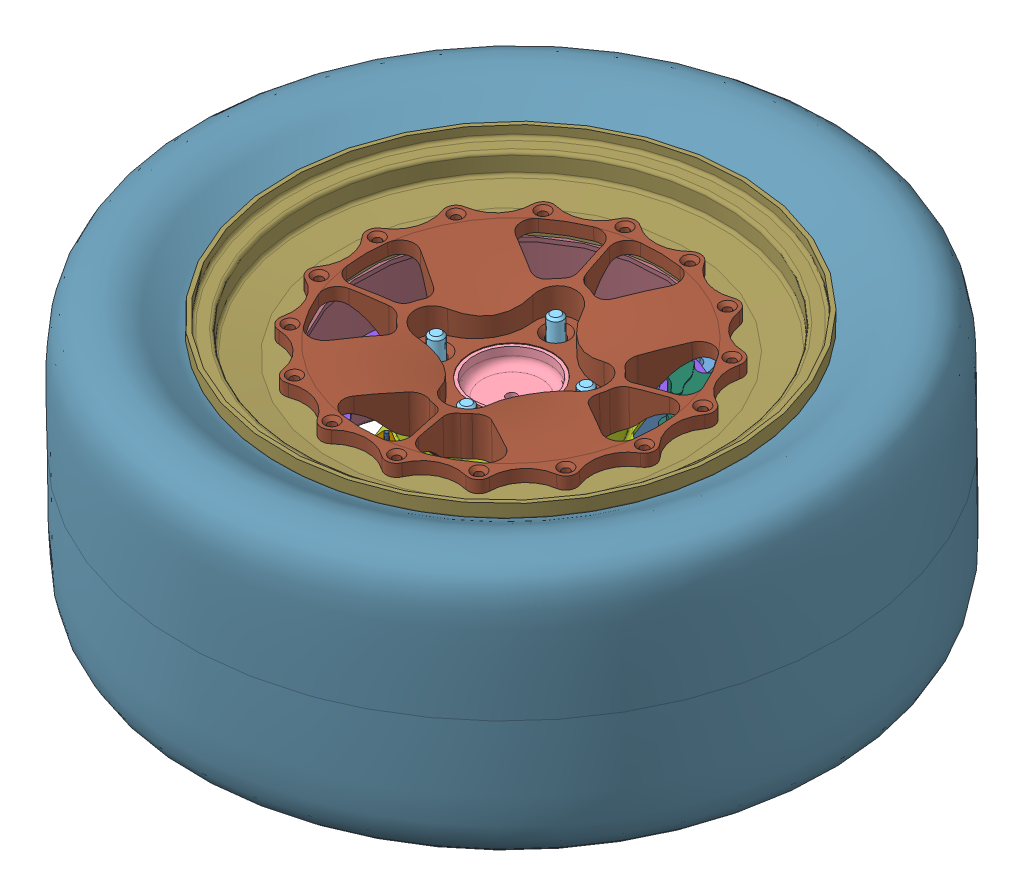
SolidWorks assembly Brake&Wheel.SLDASM, configuration Default (file format 13000). Lengths in mm.
Overall size (684.97 219.6 688.49).
46 component instances, 15 part files, 11 mates.
Components (placement in the parent):
- Upright Assembly - Mirror-3: Upright Assembly - Mirror.SLDASM [Default] at (1.0276 15.994 17.5776) size (187.69 75.94 260.67)
  - Upright - Mirror-1: Upright - Mirror.SLDPRT [AP Caliper] at (-28.1936 -601.3602 -253.5794) size (187.69 75.94 260.67)
  - Oil Seal-1: Oil Seal.SLDPRT [Default] at (-28.1936 8.8942 0.8085) x (0 -0.999848 -0.017452) z (-0.156462 -0.017237 0.987534) size (6.35 67.59 67.59)
  - Oil Seal-2: Oil Seal.SLDPRT [Default] at (-28.1936 -47.6122 -0.1778) x (0 0.999848 0.017452) z (-0.017452 -0.01745 0.999695) size (6.35 67.59 67.59)
  - Tapered Roller Bearing-1: Tapered Roller Bearing.SLDPRT [Default] at (-28.1936 -26.0254 0.199) x (0 -0.999848 -0.017452) z (0.934797 -0.006199 0.355129) size (17 55 55)
  - Tapered Roller Bearing-2: Tapered Roller Bearing.SLDPRT [Default] at (-28.1936 -15.7273 0.3787) x (0 0.999848 0.017452) z (0.612483 -0.013796 0.790364) size (17 55 55)
- Hub Assembly-1: Hub Assembly.SLDASM [Default] at (-27.166 37.2635 18.6021) x (0 0.999848 0.017452) z (-0.859335 0.008925 -0.511335) size (81.66 92.75 92.75)
  - Hub - Aluminum-1: Hub - Aluminum.SLDPRT [SPLIT LINES] at (-63.5 0 0) size (68.33 92.75 92.75)
  - Wheel Stud-1: Wheel Stud.SLDPRT [LUG NUT CUT DOWN] at (-15.24 -33.676 33.676) x (1 0 0) z (0 0.091677 0.995789) size (41.27 15.88 15.88)
  - Wheel Stud-2: Wheel Stud.SLDPRT [LUG NUT CUT DOWN] at (-15.24 33.676 33.676) x (1 0 0) z (0 0.995789 -0.091677) size (41.27 15.88 15.88)
  - Wheel Stud-3: Wheel Stud.SLDPRT [LUG NUT CUT DOWN] at (-15.24 33.676 -33.676) x (1 0 0) z (0 -0.091677 -0.995789) size (41.27 15.88 15.88)
  - Wheel Stud-4: Wheel Stud.SLDPRT [LUG NUT CUT DOWN] at (-15.24 -33.676 -33.676) x (1 0 0) z (0 -0.995789 0.091677) size (41.27 15.88 15.88)
  - Hub Washer-1: Hub Washer.SLDPRT [NO_SPLITLINE] at (-20.0025 0 0) x (1 0 0) z (0 0.089607 0.995977) size (11.11 57.71 57.71)
- Brake Rotor Assembly-1: Brake Rotor Assembly.SLDASM [Default] at (-32.128 51.201 -11.271) x (0 0.999848 0.017452) z (0.969265 0.004294 -0.245981) size (25.91 327.78 327.78)
  - Rotor Hat-1: Rotor Hat.SLDPRT [Default] at (-34.2242 30.4071 -2.5985) size (23.6 152.4 152.4)
  - Rotor - Cast Iron-1: Rotor - Cast Iron.SLDPRT [Default] at (-31.2397 30.4071 -2.5985) x (0 0.707107 0.707107) z (-1 0 0) size (231.78 231.78 3.17)
  - Rotor Washer-1: Rotor Washer.SLDPRT [Default] at (-31.2397 33.0101 -12.653) x (0 0.99948 0.032253) z (1 0 0) size (18.57 10.78 1.59)
  - Rotor Washer-27: Rotor Washer.SLDPRT [Chamfer] at (-34.4147 41.3596 -11.9484) x (0 -0.990749 -0.135705) z (-1 0 0) size (18.57 10.78 1.59)
  - Rotor Pin-6: Rotor Pin.SLDPRT [.5] at (-34.9647 30.4071 68.0135) x (0 0.996402 -0.084747) z (-1 0 0) size (6.36 6.36 12.79)
  - Rotor Washer-13: Rotor Washer.SLDPRT [Default] at (-31.2397 25.1381 -11.5488) x (0 0.729545 -0.683933) z (1 0 0) size (18.57 10.78 1.59)
  - Rotor Washer-14: Rotor Washer.SLDPRT [Default] at (-31.2397 20.3526 -5.2016) x (0 0.032253 -0.99948) z (1 0 0) size (18.57 10.78 1.59)
  - Rotor Washer-15: Rotor Washer.SLDPRT [Default] at (-31.2397 21.4568 2.6705) x (0 -0.683933 -0.729545) z (1 0 0) size (18.57 10.78 1.59)
  - Rotor Washer-16: Rotor Washer.SLDPRT [Default] at (-31.2397 27.804 7.456) x (0 -0.99948 -0.032253) z (1 0 0) size (18.57 10.78 1.59)
  - Rotor Washer-17: Rotor Washer.SLDPRT [Default] at (-31.2397 35.676 6.3518) x (0 -0.729545 0.683933) z (1 0 0) size (18.57 10.78 1.59)
  - Rotor Pin-7: Rotor Pin.SLDPRT [.5] at (-34.9647 80.3373 47.3317) x (0 0.644638 -0.764488) z (-1 0 0) size (6.36 6.36 12.79)
  - Rotor Pin-8: Rotor Pin.SLDPRT [.5] at (-34.9647 101.0191 -2.5985) x (0 -0.084747 -0.996402) z (-1 0 0) size (6.36 6.36 12.79)
  - Rotor Pin-9: Rotor Pin.SLDPRT [.5] at (-34.9647 80.3373 -52.5287) x (0 -0.764488 -0.644638) z (-1 0 0) size (6.36 6.36 12.79)
  - Rotor Pin-10: Rotor Pin.SLDPRT [.5] at (-34.9647 30.4071 -73.2105) x (0 -0.996402 0.084747) z (-1 0 0) size (6.36 6.36 12.79)
  - Rotor Pin-11: Rotor Pin.SLDPRT [.5] at (-34.9647 -19.5231 -52.5287) x (0 -0.644638 0.764488) z (-1 0 0) size (6.36 6.36 12.79)
  - Rotor Pin-12: Rotor Pin.SLDPRT [.5] at (-34.9647 -40.2049 -2.5985) x (0 0.084747 0.996402) z (-1 0 0) size (6.36 6.36 12.79)
  - Rotor Pin-13: Rotor Pin.SLDPRT [.5] at (-34.9647 -19.5231 47.3317) x (0 0.764488 0.644638) z (-1 0 0) size (6.36 6.36 12.79)
  - Rotor Washer-25: Rotor Washer.SLDPRT [Default] at (-31.2397 40.4616 0.0046) x (0 -0.032253 0.99948) z (1 0 0) size (18.57 10.78 1.59)
  - Rotor Washer-26: Rotor Washer.SLDPRT [Default] at (-31.2397 39.3573 -7.8675) x (0 0.683933 0.729545) z (1 0 0) size (18.57 10.78 1.59)
  - Rotor Washer-28: Rotor Washer.SLDPRT [Chamfer] at (-34.4147 31.5403 -16.9545) x (0 -0.796524 0.604608) z (-1 0 0) size (18.57 10.78 1.59)
  - Rotor Washer-29: Rotor Washer.SLDPRT [Chamfer] at (-34.4147 21.0572 -13.551) x (0 -0.135705 0.990749) z (-1 0 0) size (18.57 10.78 1.59)
  - Rotor Washer-30: Rotor Washer.SLDPRT [Chamfer] at (-34.4147 16.0511 -3.7317) x (0 0.604608 0.796524) z (-1 0 0) size (18.57 10.78 1.59)
  - Rotor Washer-31: Rotor Washer.SLDPRT [Chamfer] at (-34.4147 19.4545 6.7514) x (0 0.990749 0.135705) z (-1 0 0) size (18.57 10.78 1.59)
  - Rotor Washer-32: Rotor Washer.SLDPRT [Chamfer] at (-34.4147 29.2738 11.7575) x (0 0.796524 -0.604608) z (-1 0 0) size (18.57 10.78 1.59)
  - Rotor Washer-33: Rotor Washer.SLDPRT [Chamfer] at (-34.4147 39.757 8.3541) x (0 0.135705 -0.990749) z (-1 0 0) size (18.57 10.78 1.59)
  - Rotor Washer-34: Rotor Washer.SLDPRT [Chamfer] at (-34.4147 44.7631 -1.4652) x (0 -0.604608 -0.796524) z (-1 0 0) size (18.57 10.78 1.59)
- Wheel Assembly-1: Wheel Assembly.SLDASM [Default] at (-27.166 65.4533 19.0941) x (-0.246018 0.016916 -0.969118) z (0 0.999848 0.017452) size (563.63 563.63 207.68)
  - Wheel Center - Aluminum-1: Wheel Center - Aluminum.SLDPRT [Default] at origin size (260.35 260.35 36.14)
  - Wheel Shell - Outer-1: Wheel Shell - Outer.SLDPRT [Default] at (0 0 -3.175) x (0 0 1) z (-0.92388 -0.382683 0) size (31.75 355.6 355.6)
  - Wheel Shell - Inner-1: Wheel Shell - Inner.SLDPRT [Default] at (0 0 -3.175) x (0 0 1) z (-0.707107 -0.707107 0) size (151 355.6 355.6)
  - Tire-1: Tire.SLDPRT [Default] at (0 0 -62.8015) x (0 0 -1) z (0.993511 0.113735 0) size (207.68 509.04 509.04)
- Brake Caliper-1: Brake Caliper.SLDPRT [Default] at (73.5704 19.2772 -63.2993) x (-0.62932 0.013563 -0.777028) z (0 -0.999848 -0.017452) size (81.53 52.96 65.79)
Mates (geometry in assembly coordinates):
- Concentric3: concentric anti-aligned: cylinder of Upright Assembly - Mirror-3/Tapered Roller Bearing-2 through (-27.166 0.2667 17.9563) axis (0 -0.999848 -0.017452) radius 15; cylinder of Hub Assembly-1/Hub - Aluminum-1 through (-27.166 183.3399 21.1519) axis (0 0.999848 0.017452) radius 15
- Coincident2: coincident anti-aligned: plane of Upright Assembly - Mirror-3/Tapered Roller Bearing-2 through (-42.5804 17.0556 30.1946) normal (0 0.999848 0.017452); plane of Hub Assembly-1/Hub Washer-1 through (-18.3706 17.4762 6.1041) normal (0 -0.999848 -0.017452)
- Coincident3: coincident anti-aligned: plane of Hub Assembly-1/Hub - Aluminum-1 through (5.3087 38.2159 -35.9574) normal (0 0.999848 0.017452); plane of Brake Rotor Assembly-1/Rotor Hat-1 through (-18.77 36.6862 51.6753) normal (0 -0.999848 -0.017452)
- Concentric9: concentric anti-aligned: cylinder of Hub Assembly-1/Hub - Aluminum-1 through (-27.166 -72.7366 16.682) axis (0 -0.999848 -0.017452) radius 31.75; cylinder of Wheel Assembly-1/Wheel Center - Aluminum-1 through (-27.166 40.0571 18.6509) axis (0 0.999848 0.017452) radius 31.75
- Coincident6: coincident anti-aligned: plane of Brake Rotor Assembly-1/Rotor Hat-1 through (-12.1999 39.0281 77.6052) normal (0 0.999848 0.017452); plane of Wheel Assembly-1/Wheel Center - Aluminum-1 through (-27.166 40.0571 18.6509) normal (0 -0.999848 -0.017452)
- Concentric10: concentric anti-aligned: cylinder of Hub Assembly-1/Wheel Stud-3 through (18.9953 -24.6248 5.8034) axis (0 -0.999848 -0.017452) radius 5.5563; cylinder of Wheel Assembly-1/Wheel Center - Aluminum-1 through (18.9953 40.2616 6.936) axis (0 0.999848 0.017452) radius 6.35
- Concentric11: concentric anti-aligned: cylinder of Hub Assembly-1/Hub - Aluminum-1 through (-27.166 -72.7366 16.682) axis (0 -0.999848 -0.017452) radius 31.75; cylinder of Brake Rotor Assembly-1/Rotor Hat-1 through (-27.166 41.2372 18.6715) axis (0 0.999848 0.017452) radius 31.877
- Concentric12: concentric anti-aligned: cylinder of Hub Assembly-1/Wheel Stud-1 through (-73.3272 -25.0338 29.2331) axis (0 -0.999848 -0.017452) radius 5.5563; cylinder of Brake Rotor Assembly-1/Rotor Hat-1 through (-73.3272 16.251 29.9537) axis (0 0.999848 0.017452) radius 5.5245
- Concentric13: concentric: cylinder of Upright Assembly - Mirror-3/Upright - Mirror-1 through (58.7503 -42.8901 -11.1983) axis (0 0.999848 0.017452) radius 4.0005; cylinder of Brake Caliper-1 through (58.75 -8.266 -10.5943) axis (0 -0.999848 -0.017452) radius 4
- Concentric14: concentric: cylinder of Upright Assembly - Mirror-3/Upright - Mirror-1 through (18.4735 -42.0221 -60.9284) axis (0 0.999848 0.017452) radius 4.0005; cylinder of Brake Caliper-1 through (18.4735 -7.398 -60.324) axis (0 -0.999848 -0.017452) radius 4
- Coincident7: coincident: plane of Upright Assembly - Mirror-3/Upright - Mirror-1 through (34.4967 -8.6751 12.8429) normal (0 0.999848 0.017452); plane of Brake Caliper-1 through (18.4735 -7.398 -60.324) normal (0 -0.999848 -0.017452)
